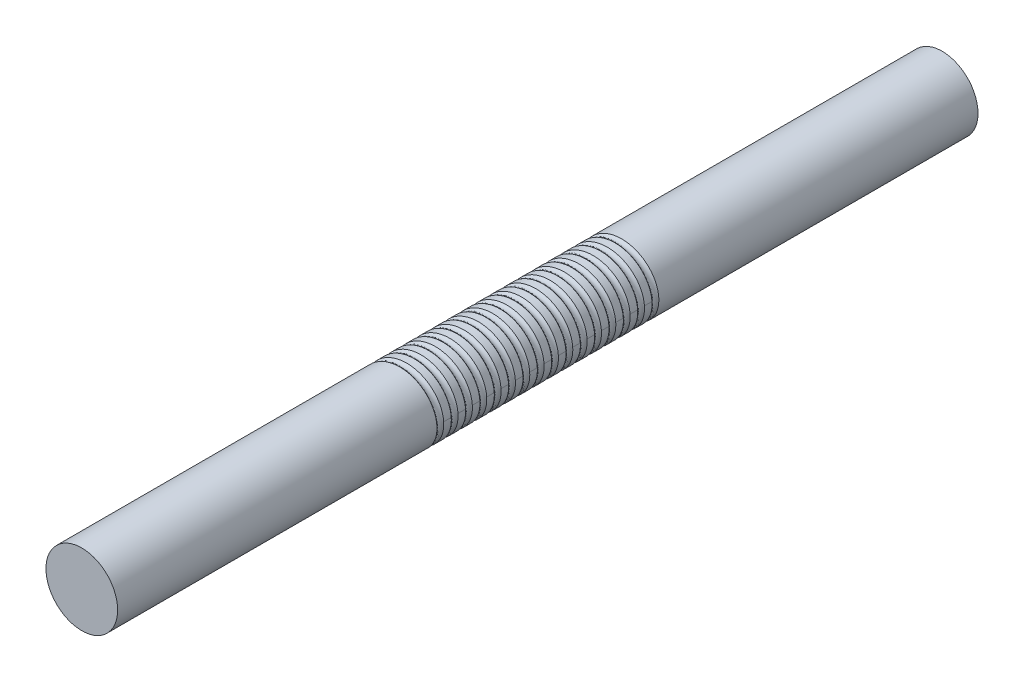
from build123d import *

# Parameters (mm, degrees)
SKETCH1_R              = 25
BOSS_EXTRUDE1_DEPTH    = 600
CUT_SWEEP1_PITCH       = 10
CUT_SWEEP1_HEIGHT      = 160
CUT_SWEEP1_RADIUS      = 27.116666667
CUT_SWEEP1_START_ANGLE = -180
SKETCH3_R              = 3.175


with BuildPart() as part:
    # Sketch1 → Boss-Extrude1 (new body)
    with BuildSketch(Plane.XY):
        Circle(SKETCH1_R)
    extrude(amount=BOSS_EXTRUDE1_DEPTH)

    # Cut-Sweep1: sweep along a helix
    with BuildLine() as cut_sweep1_path:
        add(Helix(CUT_SWEEP1_PITCH, CUT_SWEEP1_HEIGHT, CUT_SWEEP1_RADIUS, center=(0, 0, 220), direction=(0, 0, 1), mode=Mode.PRIVATE).rotate(Axis((0, 0, 220), (0, 0, 1)), CUT_SWEEP1_START_ANGLE))
    # Sketch3 → Cut-Sweep1 (sweep, cut)
    with BuildSketch(Plane(origin=(0, 0, 0), x_dir=(1, 0, 0), z_dir=(0, 1, 0))):
        with Locations((-27.116666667, -220)):
            Circle(SKETCH3_R)
    sweep(path=cut_sweep1_path.line, is_frenet=True, mode=Mode.SUBTRACT)


solid = part.part
